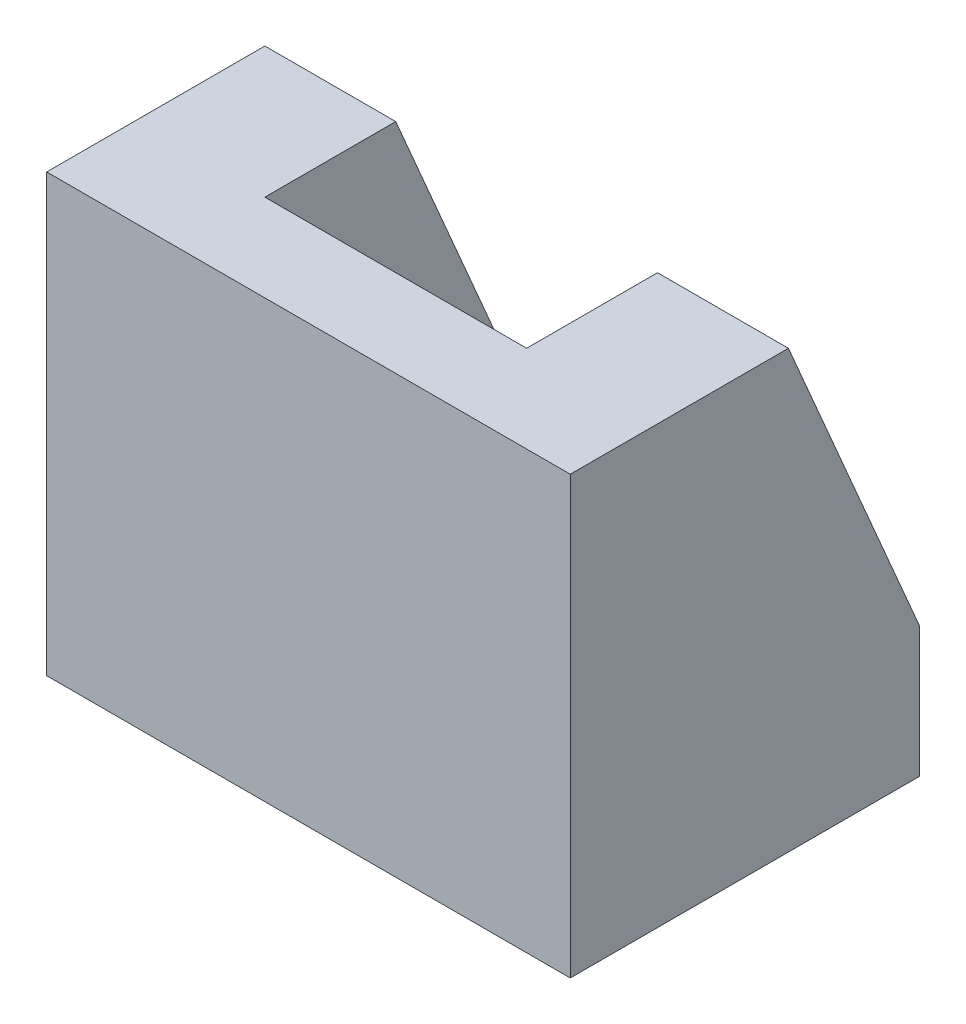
ISO-10303-21;
HEADER;
FILE_DESCRIPTION(('STEP AP214'),'2;1');
FILE_NAME('part.step','',(''),(''),'','','');
FILE_SCHEMA(('AUTOMOTIVE_DESIGN { 1 0 10303 214 1 1 1 1 }'));
ENDSEC;
DATA;
#1=APPLICATION_CONTEXT('core data for automotive mechanical design processes');
#2=APPLICATION_PROTOCOL_DEFINITION('international standard','automotive_design',2000,#1);
#3=PRODUCT_CONTEXT('',#1,'mechanical');
#4=PRODUCT('Part','Part','',(#3));
#5=PRODUCT_RELATED_PRODUCT_CATEGORY('part','',(#4));
#6=PRODUCT_DEFINITION_FORMATION('','',#4);
#7=PRODUCT_DEFINITION_CONTEXT('part definition',#1,'design');
#8=PRODUCT_DEFINITION('design','',#6,#7);
#9=PRODUCT_DEFINITION_SHAPE('','',#8);
#10=(LENGTH_UNIT() NAMED_UNIT(*) SI_UNIT(.MILLI.,.METRE.));
#11=(NAMED_UNIT(*) PLANE_ANGLE_UNIT() SI_UNIT($,.RADIAN.));
#12=(NAMED_UNIT(*) SI_UNIT($,.STERADIAN.) SOLID_ANGLE_UNIT());
#13=UNCERTAINTY_MEASURE_WITH_UNIT(LENGTH_MEASURE(1.E-05),#10,'distance_accuracy_value','');
#14=(GEOMETRIC_REPRESENTATION_CONTEXT(3) GLOBAL_UNCERTAINTY_ASSIGNED_CONTEXT((#13)) GLOBAL_UNIT_ASSIGNED_CONTEXT((#10,
#11,#12)) REPRESENTATION_CONTEXT('',''));
#15=CARTESIAN_POINT('',(0.,0.,0.));
#16=DIRECTION('',(0.,0.,1.));
#17=DIRECTION('',(1.,0.,0.));
#18=AXIS2_PLACEMENT_3D('',#15,#16,#17);
#19=CARTESIAN_POINT('',(120.,100.,-50.));
#20=DIRECTION('',(0.,-0.393919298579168,0.919145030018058));
#21=DIRECTION('',(0.,-0.919145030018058,-0.393919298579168));
#22=AXIS2_PLACEMENT_3D('',#19,#20,#21);
#23=PLANE('',#22);
#24=DIRECTION('',(-1.,0.,0.));
#25=VECTOR('',#24,1.);
#26=CARTESIAN_POINT('',(120.,100.,-50.));
#27=LINE('',#26,#25);
#28=CARTESIAN_POINT('',(30.,100.,-50.));
#29=VERTEX_POINT('',#28);
#30=CARTESIAN_POINT('',(0.,100.,-50.));
#31=VERTEX_POINT('',#30);
#32=EDGE_CURVE('E137',#29,#31,#27,.T.);
#33=ORIENTED_EDGE('',*,*,#32,.F.);
#34=DIRECTION('',(0.,-0.919145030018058,-0.393919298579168));
#35=VECTOR('',#34,1.);
#36=CARTESIAN_POINT('',(30.,100.,-50.));
#37=LINE('',#36,#35);
#38=CARTESIAN_POINT('',(30.,30.,-80.));
#39=VERTEX_POINT('',#38);
#40=EDGE_CURVE('E127',#29,#39,#37,.T.);
#41=ORIENTED_EDGE('',*,*,#40,.T.);
#42=DIRECTION('',(-1.,0.,0.));
#43=VECTOR('',#42,1.);
#44=CARTESIAN_POINT('',(120.,30.,-80.));
#45=LINE('',#44,#43);
#46=CARTESIAN_POINT('',(0.,30.,-80.));
#47=VERTEX_POINT('',#46);
#48=EDGE_CURVE('E113',#39,#47,#45,.T.);
#49=ORIENTED_EDGE('',*,*,#48,.T.);
#50=DIRECTION('',(0.,0.919145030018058,0.393919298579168));
#51=VECTOR('',#50,1.);
#52=CARTESIAN_POINT('',(0.,100.,-50.));
#53=LINE('',#52,#51);
#54=EDGE_CURVE('E131',#47,#31,#53,.T.);
#55=ORIENTED_EDGE('',*,*,#54,.T.);
#56=EDGE_LOOP('',(#33,#41,#49,#55));
#57=FACE_BOUND('',#56,.T.);
#58=ADVANCED_FACE('F30',(#57),#23,.F.);
#59=CARTESIAN_POINT('',(120.,0.,0.));
#60=DIRECTION('',(0.,0.,-1.));
#61=DIRECTION('',(-1.,0.,0.));
#62=AXIS2_PLACEMENT_3D('',#59,#60,#61);
#63=PLANE('',#62);
#64=DIRECTION('',(0.,-1.,0.));
#65=VECTOR('',#64,1.);
#66=CARTESIAN_POINT('',(0.,0.,0.));
#67=LINE('',#66,#65);
#68=CARTESIAN_POINT('',(0.,100.,0.));
#69=VERTEX_POINT('',#68);
#70=CARTESIAN_POINT('',(0.,0.,0.));
#71=VERTEX_POINT('',#70);
#72=EDGE_CURVE('E123',#69,#71,#67,.T.);
#73=ORIENTED_EDGE('',*,*,#72,.T.);
#74=DIRECTION('',(-1.,0.,0.));
#75=VECTOR('',#74,1.);
#76=CARTESIAN_POINT('',(120.,0.,0.));
#77=LINE('',#76,#75);
#78=CARTESIAN_POINT('',(120.,0.,0.));
#79=VERTEX_POINT('',#78);
#80=EDGE_CURVE('E38',#79,#71,#77,.T.);
#81=ORIENTED_EDGE('',*,*,#80,.F.);
#82=DIRECTION('',(0.,-1.,0.));
#83=VECTOR('',#82,1.);
#84=CARTESIAN_POINT('',(120.,0.,0.));
#85=LINE('',#84,#83);
#86=CARTESIAN_POINT('',(120.,100.,0.));
#87=VERTEX_POINT('',#86);
#88=EDGE_CURVE('E135',#87,#79,#85,.T.);
#89=ORIENTED_EDGE('',*,*,#88,.F.);
#90=DIRECTION('',(-1.,0.,0.));
#91=VECTOR('',#90,1.);
#92=CARTESIAN_POINT('',(120.,100.,0.));
#93=LINE('',#92,#91);
#94=EDGE_CURVE('E119',#87,#69,#93,.T.);
#95=ORIENTED_EDGE('',*,*,#94,.T.);
#96=EDGE_LOOP('',(#73,#81,#89,#95));
#97=FACE_BOUND('',#96,.T.);
#98=ADVANCED_FACE('F32',(#97),#63,.F.);
#99=CARTESIAN_POINT('',(120.,0.,0.));
#100=DIRECTION('',(0.,1.,0.));
#101=DIRECTION('',(0.,0.,1.));
#102=AXIS2_PLACEMENT_3D('',#99,#100,#101);
#103=PLANE('',#102);
#104=DIRECTION('',(0.,0.,-1.));
#105=VECTOR('',#104,1.);
#106=CARTESIAN_POINT('',(0.,0.,0.));
#107=LINE('',#106,#105);
#108=CARTESIAN_POINT('',(0.,0.,-80.));
#109=VERTEX_POINT('',#108);
#110=EDGE_CURVE('E126',#71,#109,#107,.T.);
#111=ORIENTED_EDGE('',*,*,#110,.T.);
#112=DIRECTION('',(-1.,0.,0.));
#113=VECTOR('',#112,1.);
#114=CARTESIAN_POINT('',(120.,0.,-80.));
#115=LINE('',#114,#113);
#116=CARTESIAN_POINT('',(120.,0.,-80.));
#117=VERTEX_POINT('',#116);
#118=EDGE_CURVE('E112',#117,#109,#115,.T.);
#119=ORIENTED_EDGE('',*,*,#118,.F.);
#120=DIRECTION('',(0.,0.,-1.));
#121=VECTOR('',#120,1.);
#122=CARTESIAN_POINT('',(120.,0.,0.));
#123=LINE('',#122,#121);
#124=EDGE_CURVE('E86',#79,#117,#123,.T.);
#125=ORIENTED_EDGE('',*,*,#124,.F.);
#126=ORIENTED_EDGE('',*,*,#80,.T.);
#127=EDGE_LOOP('',(#111,#119,#125,#126));
#128=FACE_BOUND('',#127,.T.);
#129=ADVANCED_FACE('F140',(#128),#103,.F.);
#130=CARTESIAN_POINT('',(120.,0.,-80.));
#131=DIRECTION('',(0.,0.,1.));
#132=DIRECTION('',(1.,0.,0.));
#133=AXIS2_PLACEMENT_3D('',#130,#131,#132);
#134=PLANE('',#133);
#135=DIRECTION('',(0.,1.,0.));
#136=VECTOR('',#135,1.);
#137=CARTESIAN_POINT('',(0.,0.,-80.));
#138=LINE('',#137,#136);
#139=EDGE_CURVE('E129',#109,#47,#138,.T.);
#140=ORIENTED_EDGE('',*,*,#139,.T.);
#141=ORIENTED_EDGE('',*,*,#48,.F.);
#142=DIRECTION('',(-1.,0.,0.));
#143=VECTOR('',#142,1.);
#144=CARTESIAN_POINT('',(30.,30.,-80.));
#145=LINE('',#144,#143);
#146=CARTESIAN_POINT('',(90.,30.,-80.));
#147=VERTEX_POINT('',#146);
#148=EDGE_CURVE('E109',#147,#39,#145,.T.);
#149=ORIENTED_EDGE('',*,*,#148,.F.);
#150=CARTESIAN_POINT('',(120.,30.,-80.));
#151=VERTEX_POINT('',#150);
#152=EDGE_CURVE('E103',#151,#147,#45,.T.);
#153=ORIENTED_EDGE('',*,*,#152,.F.);
#154=DIRECTION('',(0.,1.,0.));
#155=VECTOR('',#154,1.);
#156=CARTESIAN_POINT('',(120.,0.,-80.));
#157=LINE('',#156,#155);
#158=EDGE_CURVE('E92',#117,#151,#157,.T.);
#159=ORIENTED_EDGE('',*,*,#158,.F.);
#160=ORIENTED_EDGE('',*,*,#118,.T.);
#161=EDGE_LOOP('',(#140,#141,#149,#153,#159,#160));
#162=FACE_BOUND('',#161,.T.);
#163=ADVANCED_FACE('F105',(#162),#134,.F.);
#164=ORIENTED_EDGE('',*,*,#152,.T.);
#165=DIRECTION('',(0.,0.919145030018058,0.393919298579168));
#166=VECTOR('',#165,1.);
#167=CARTESIAN_POINT('',(90.,100.,-50.));
#168=LINE('',#167,#166);
#169=CARTESIAN_POINT('',(90.,100.,-50.));
#170=VERTEX_POINT('',#169);
#171=EDGE_CURVE('E158',#147,#170,#168,.T.);
#172=ORIENTED_EDGE('',*,*,#171,.T.);
#173=CARTESIAN_POINT('',(120.,100.,-50.));
#174=VERTEX_POINT('',#173);
#175=EDGE_CURVE('E117',#174,#170,#27,.T.);
#176=ORIENTED_EDGE('',*,*,#175,.F.);
#177=DIRECTION('',(0.,0.919145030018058,0.393919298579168));
#178=VECTOR('',#177,1.);
#179=CARTESIAN_POINT('',(120.,100.,-50.));
#180=LINE('',#179,#178);
#181=EDGE_CURVE('E96',#151,#174,#180,.T.);
#182=ORIENTED_EDGE('',*,*,#181,.F.);
#183=EDGE_LOOP('',(#164,#172,#176,#182));
#184=FACE_BOUND('',#183,.T.);
#185=ADVANCED_FACE('F115',(#184),#23,.F.);
#186=CARTESIAN_POINT('',(120.,100.,0.));
#187=DIRECTION('',(0.,-1.,0.));
#188=DIRECTION('',(0.,0.,-1.));
#189=AXIS2_PLACEMENT_3D('',#186,#187,#188);
#190=PLANE('',#189);
#191=DIRECTION('',(1.,0.,0.));
#192=VECTOR('',#191,1.);
#193=CARTESIAN_POINT('',(30.,100.,-20.));
#194=LINE('',#193,#192);
#195=CARTESIAN_POINT('',(30.,100.,-20.));
#196=VERTEX_POINT('',#195);
#197=CARTESIAN_POINT('',(90.,100.,-20.));
#198=VERTEX_POINT('',#197);
#199=EDGE_CURVE('E45',#196,#198,#194,.T.);
#200=ORIENTED_EDGE('',*,*,#199,.F.);
#201=DIRECTION('',(0.,0.,-1.));
#202=VECTOR('',#201,1.);
#203=CARTESIAN_POINT('',(30.,100.,0.));
#204=LINE('',#203,#202);
#205=EDGE_CURVE('E11',#196,#29,#204,.T.);
#206=ORIENTED_EDGE('',*,*,#205,.T.);
#207=ORIENTED_EDGE('',*,*,#32,.T.);
#208=DIRECTION('',(0.,0.,1.));
#209=VECTOR('',#208,1.);
#210=CARTESIAN_POINT('',(0.,100.,0.));
#211=LINE('',#210,#209);
#212=EDGE_CURVE('E77',#31,#69,#211,.T.);
#213=ORIENTED_EDGE('',*,*,#212,.T.);
#214=ORIENTED_EDGE('',*,*,#94,.F.);
#215=DIRECTION('',(0.,0.,1.));
#216=VECTOR('',#215,1.);
#217=CARTESIAN_POINT('',(120.,100.,0.));
#218=LINE('',#217,#216);
#219=EDGE_CURVE('E54',#174,#87,#218,.T.);
#220=ORIENTED_EDGE('',*,*,#219,.F.);
#221=ORIENTED_EDGE('',*,*,#175,.T.);
#222=DIRECTION('',(0.,0.,-1.));
#223=VECTOR('',#222,1.);
#224=CARTESIAN_POINT('',(90.,100.,-80.));
#225=LINE('',#224,#223);
#226=EDGE_CURVE('E168',#198,#170,#225,.T.);
#227=ORIENTED_EDGE('',*,*,#226,.F.);
#228=EDGE_LOOP('',(#200,#206,#207,#213,#214,#220,#221,#227));
#229=FACE_BOUND('',#228,.T.);
#230=ADVANCED_FACE('F194',(#229),#190,.F.);
#231=CARTESIAN_POINT('',(120.,100.,0.));
#232=DIRECTION('',(-1.,0.,0.));
#233=DIRECTION('',(0.,0.,1.));
#234=AXIS2_PLACEMENT_3D('',#231,#232,#233);
#235=PLANE('',#234);
#236=ORIENTED_EDGE('',*,*,#88,.T.);
#237=ORIENTED_EDGE('',*,*,#124,.T.);
#238=ORIENTED_EDGE('',*,*,#158,.T.);
#239=ORIENTED_EDGE('',*,*,#181,.T.);
#240=ORIENTED_EDGE('',*,*,#219,.T.);
#241=EDGE_LOOP('',(#236,#237,#238,#239,#240));
#242=FACE_BOUND('',#241,.T.);
#243=ADVANCED_FACE('F94',(#242),#235,.F.);
#244=CARTESIAN_POINT('',(0.,100.,0.));
#245=DIRECTION('',(-1.,0.,0.));
#246=DIRECTION('',(0.,0.,1.));
#247=AXIS2_PLACEMENT_3D('',#244,#245,#246);
#248=PLANE('',#247);
#249=ORIENTED_EDGE('',*,*,#72,.F.);
#250=ORIENTED_EDGE('',*,*,#212,.F.);
#251=ORIENTED_EDGE('',*,*,#54,.F.);
#252=ORIENTED_EDGE('',*,*,#139,.F.);
#253=ORIENTED_EDGE('',*,*,#110,.F.);
#254=EDGE_LOOP('',(#249,#250,#251,#252,#253));
#255=FACE_BOUND('',#254,.T.);
#256=ADVANCED_FACE('F145',(#255),#248,.T.);
#257=CARTESIAN_POINT('',(30.,30.,-20.));
#258=DIRECTION('',(-1.,0.,0.));
#259=DIRECTION('',(0.,0.,1.));
#260=AXIS2_PLACEMENT_3D('',#257,#258,#259);
#261=PLANE('',#260);
#262=ORIENTED_EDGE('',*,*,#205,.F.);
#263=DIRECTION('',(0.,1.,0.));
#264=VECTOR('',#263,1.);
#265=CARTESIAN_POINT('',(30.,30.,-20.));
#266=LINE('',#265,#264);
#267=CARTESIAN_POINT('',(30.,30.,-20.));
#268=VERTEX_POINT('',#267);
#269=EDGE_CURVE('E160',#268,#196,#266,.T.);
#270=ORIENTED_EDGE('',*,*,#269,.F.);
#271=DIRECTION('',(0.,0.,1.));
#272=VECTOR('',#271,1.);
#273=CARTESIAN_POINT('',(30.,30.,-20.));
#274=LINE('',#273,#272);
#275=EDGE_CURVE('E166',#39,#268,#274,.T.);
#276=ORIENTED_EDGE('',*,*,#275,.F.);
#277=ORIENTED_EDGE('',*,*,#40,.F.);
#278=EDGE_LOOP('',(#262,#270,#276,#277));
#279=FACE_BOUND('',#278,.T.);
#280=ADVANCED_FACE('F193',(#279),#261,.F.);
#281=CARTESIAN_POINT('',(90.,30.,-80.));
#282=DIRECTION('',(1.,0.,0.));
#283=DIRECTION('',(0.,0.,-1.));
#284=AXIS2_PLACEMENT_3D('',#281,#282,#283);
#285=PLANE('',#284);
#286=DIRECTION('',(0.,0.,-1.));
#287=VECTOR('',#286,1.);
#288=CARTESIAN_POINT('',(90.,30.,-80.));
#289=LINE('',#288,#287);
#290=CARTESIAN_POINT('',(90.,30.,-20.));
#291=VERTEX_POINT('',#290);
#292=EDGE_CURVE('E176',#291,#147,#289,.T.);
#293=ORIENTED_EDGE('',*,*,#292,.F.);
#294=DIRECTION('',(0.,1.,0.));
#295=VECTOR('',#294,1.);
#296=CARTESIAN_POINT('',(90.,30.,-20.));
#297=LINE('',#296,#295);
#298=EDGE_CURVE('E164',#291,#198,#297,.T.);
#299=ORIENTED_EDGE('',*,*,#298,.T.);
#300=ORIENTED_EDGE('',*,*,#226,.T.);
#301=ORIENTED_EDGE('',*,*,#171,.F.);
#302=EDGE_LOOP('',(#293,#299,#300,#301));
#303=FACE_BOUND('',#302,.T.);
#304=ADVANCED_FACE('F198',(#303),#285,.F.);
#305=CARTESIAN_POINT('',(30.,30.,-20.));
#306=DIRECTION('',(0.,0.,1.));
#307=DIRECTION('',(1.,0.,0.));
#308=AXIS2_PLACEMENT_3D('',#305,#306,#307);
#309=PLANE('',#308);
#310=ORIENTED_EDGE('',*,*,#199,.T.);
#311=ORIENTED_EDGE('',*,*,#298,.F.);
#312=DIRECTION('',(1.,0.,0.));
#313=VECTOR('',#312,1.);
#314=CARTESIAN_POINT('',(30.,30.,-20.));
#315=LINE('',#314,#313);
#316=EDGE_CURVE('E171',#268,#291,#315,.T.);
#317=ORIENTED_EDGE('',*,*,#316,.F.);
#318=ORIENTED_EDGE('',*,*,#269,.T.);
#319=EDGE_LOOP('',(#310,#311,#317,#318));
#320=FACE_BOUND('',#319,.T.);
#321=ADVANCED_FACE('F187',(#320),#309,.F.);
#322=CARTESIAN_POINT('',(90.,30.,-20.));
#323=DIRECTION('',(0.,-1.,0.));
#324=DIRECTION('',(0.,0.,-1.));
#325=AXIS2_PLACEMENT_3D('',#322,#323,#324);
#326=PLANE('',#325);
#327=ORIENTED_EDGE('',*,*,#316,.T.);
#328=ORIENTED_EDGE('',*,*,#292,.T.);
#329=ORIENTED_EDGE('',*,*,#148,.T.);
#330=ORIENTED_EDGE('',*,*,#275,.T.);
#331=EDGE_LOOP('',(#327,#328,#329,#330));
#332=FACE_BOUND('',#331,.T.);
#333=ADVANCED_FACE('F183',(#332),#326,.F.);
#334=CLOSED_SHELL('',(#58,#98,#129,#163,#185,#230,#243,#256,#280,#304,#321,#333));
#335=MANIFOLD_SOLID_BREP('B2',#334);
#336=ADVANCED_BREP_SHAPE_REPRESENTATION('',(#18,#335),#14);
#337=SHAPE_DEFINITION_REPRESENTATION(#9,#336);
ENDSEC;
END-ISO-10303-21;
